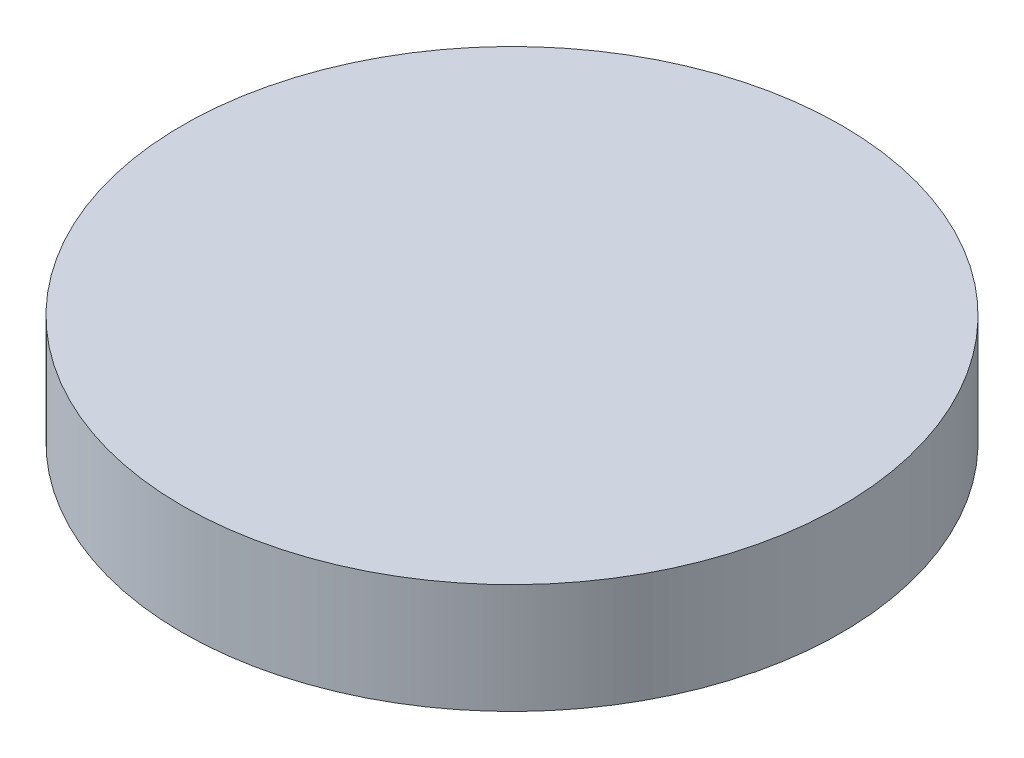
from build123d import *

# Parameters (mm, degrees)
BOSS_EXTRUDE1_START = 0.5
SKETCH1_R           = 3
BOSS_EXTRUDE1_DEPTH = 1


with BuildPart() as part:
    # Sketch1 → Boss-Extrude1 (new body)
    with BuildSketch(Plane(origin=(0, 0, 0), x_dir=(1, 0, 0), z_dir=(0, 1, 0)).offset(BOSS_EXTRUDE1_START)):
        with Locations(Location((0, 0, 0), (0, 0, 270))):
            Circle(SKETCH1_R)
    extrude(amount=-BOSS_EXTRUDE1_DEPTH)


solid = part.part
